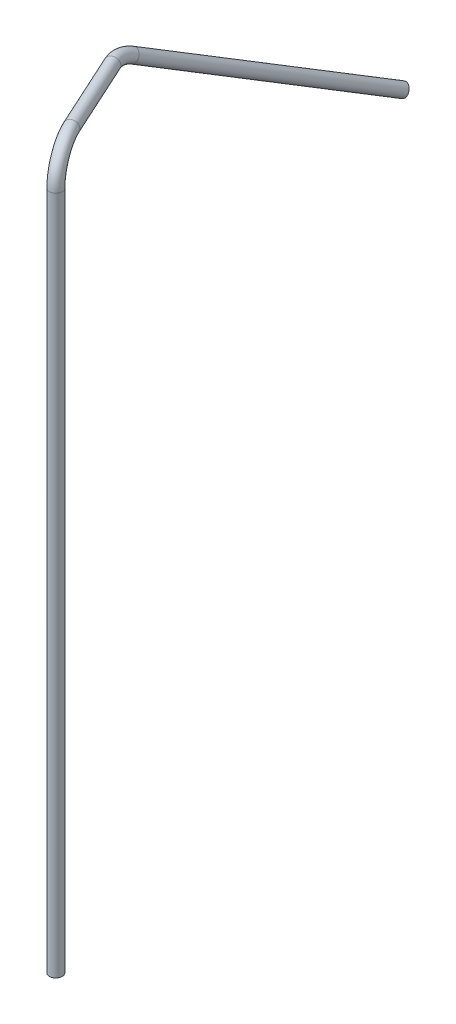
ISO-10303-21;
HEADER;
FILE_DESCRIPTION(('STEP AP214'),'2;1');
FILE_NAME('part.step','',(''),(''),'','','');
FILE_SCHEMA(('AUTOMOTIVE_DESIGN { 1 0 10303 214 1 1 1 1 }'));
ENDSEC;
DATA;
#1=APPLICATION_CONTEXT('core data for automotive mechanical design processes');
#2=APPLICATION_PROTOCOL_DEFINITION('international standard','automotive_design',2000,#1);
#3=PRODUCT_CONTEXT('',#1,'mechanical');
#4=PRODUCT('Part','Part','',(#3));
#5=PRODUCT_RELATED_PRODUCT_CATEGORY('part','',(#4));
#6=PRODUCT_DEFINITION_FORMATION('','',#4);
#7=PRODUCT_DEFINITION_CONTEXT('part definition',#1,'design');
#8=PRODUCT_DEFINITION('design','',#6,#7);
#9=PRODUCT_DEFINITION_SHAPE('','',#8);
#10=(LENGTH_UNIT() NAMED_UNIT(*) SI_UNIT(.MILLI.,.METRE.));
#11=(NAMED_UNIT(*) PLANE_ANGLE_UNIT() SI_UNIT($,.RADIAN.));
#12=(NAMED_UNIT(*) SI_UNIT($,.STERADIAN.) SOLID_ANGLE_UNIT());
#13=UNCERTAINTY_MEASURE_WITH_UNIT(LENGTH_MEASURE(1.E-05),#10,'distance_accuracy_value','');
#14=(GEOMETRIC_REPRESENTATION_CONTEXT(3) GLOBAL_UNCERTAINTY_ASSIGNED_CONTEXT((#13)) GLOBAL_UNIT_ASSIGNED_CONTEXT((#10,
#11,#12)) REPRESENTATION_CONTEXT('',''));
#15=CARTESIAN_POINT('',(0.,0.,0.));
#16=DIRECTION('',(0.,0.,1.));
#17=DIRECTION('',(1.,0.,0.));
#18=AXIS2_PLACEMENT_3D('',#15,#16,#17);
#19=CARTESIAN_POINT('',(0.00647766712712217,-56.6921259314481,-163.561686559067));
#20=DIRECTION('',(0.199985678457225,-0.45276475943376,-0.868912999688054));
#21=DIRECTION('',(-0.458716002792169,0.740368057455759,-0.491360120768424));
#22=AXIS2_PLACEMENT_3D('',#19,#20,#21);
#23=PLANE('',#22);
#24=CARTESIAN_POINT('',(0.00647766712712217,-56.6921259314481,-163.561686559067));
#25=DIRECTION('',(0.199985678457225,-0.45276475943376,-0.868912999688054));
#26=DIRECTION('',(-0.458716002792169,0.740368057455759,-0.491360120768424));
#27=AXIS2_PLACEMENT_3D('',#24,#25,#26);
#28=CIRCLE('',#27,3.);
#29=CARTESIAN_POINT('',(-1.36967034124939,-54.4710217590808,-165.035766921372));
#30=VERTEX_POINT('',#29);
#31=EDGE_CURVE('E70',#30,#30,#28,.T.);
#32=ORIENTED_EDGE('',*,*,#31,.T.);
#33=EDGE_LOOP('',(#32));
#34=FACE_BOUND('',#33,.T.);
#35=ADVANCED_FACE('F41',(#34),#23,.T.);
#36=CARTESIAN_POINT('',(0.,-335.,0.));
#37=DIRECTION('',(0.,1.,0.));
#38=DIRECTION('',(0.,0.,1.));
#39=AXIS2_PLACEMENT_3D('',#36,#37,#38);
#40=PLANE('',#39);
#41=CARTESIAN_POINT('',(0.,-335.,0.));
#42=DIRECTION('',(0.,1.,0.));
#43=DIRECTION('',(0.,0.,1.));
#44=AXIS2_PLACEMENT_3D('',#41,#42,#43);
#45=CIRCLE('',#44,3.);
#46=CARTESIAN_POINT('',(0.,-335.,3.));
#47=VERTEX_POINT('',#46);
#48=EDGE_CURVE('E10',#47,#47,#45,.T.);
#49=ORIENTED_EDGE('',*,*,#48,.F.);
#50=EDGE_LOOP('',(#49));
#51=FACE_BOUND('',#50,.T.);
#52=ADVANCED_FACE('F80',(#51),#40,.F.);
#53=CARTESIAN_POINT('',(0.00647766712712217,-56.6921259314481,-163.561686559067));
#54=DIRECTION('',(-0.199985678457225,0.45276475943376,0.868912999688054));
#55=DIRECTION('',(0.,-0.886827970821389,0.46209971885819));
#56=AXIS2_PLACEMENT_3D('',#53,#54,#55);
#57=CYLINDRICAL_SURFACE('',#56,3.);
#58=CARTESIAN_POINT('',(-23.7918180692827,-2.81311955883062,-60.1610395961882));
#59=DIRECTION('',(0.199985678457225,-0.45276475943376,-0.868912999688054));
#60=DIRECTION('',(-0.458716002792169,0.740368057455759,-0.491360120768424));
#61=AXIS2_PLACEMENT_3D('',#58,#59,#60);
#62=CIRCLE('',#61,3.);
#63=CARTESIAN_POINT('',(-26.1557044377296,-1.45482528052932,-61.4128694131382));
#64=VERTEX_POINT('',#63);
#65=EDGE_CURVE('E66',#64,#64,#62,.T.);
#66=ORIENTED_EDGE('',*,*,#65,.T.);
#67=EDGE_LOOP('',(#66));
#68=FACE_BOUND('',#67,.T.);
#69=ORIENTED_EDGE('',*,*,#31,.F.);
#70=EDGE_LOOP('',(#69));
#71=FACE_BOUND('',#70,.T.);
#72=ADVANCED_FACE('F77',(#68,#71),#57,.T.);
#73=CARTESIAN_POINT('',(-11.9723862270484,-9.60459095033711,-53.9018905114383));
#74=DIRECTION('',(0.582341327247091,0.768119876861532,-0.266215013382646));
#75=DIRECTION('',(-0.796876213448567,0.604142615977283,0.));
#76=AXIS2_PLACEMENT_3D('',#73,#74,#75);
#77=TOROIDAL_SURFACE('',#76,15.,3.);
#78=CARTESIAN_POINT('',(-22.4511550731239,1.6306400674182E-13,-49.111563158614));
#79=DIRECTION('',(-0.415762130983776,0.,-0.909473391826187));
#80=DIRECTION('',(-0.378124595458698,0.909473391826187,0.172858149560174));
#81=AXIS2_PLACEMENT_3D('',#78,#79,#80);
#82=CIRCLE('',#81,3.);
#83=CARTESIAN_POINT('',(-24.546908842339,1.92091819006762,-48.1534976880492));
#84=VERTEX_POINT('',#83);
#85=EDGE_CURVE('E61',#84,#84,#82,.T.);
#86=CARTESIAN_POINT('',(-11.9723862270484,-9.60459095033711,-53.9018905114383));
#87=DIRECTION('',(0.582341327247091,0.768119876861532,-0.266215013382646));
#88=DIRECTION('',(-0.796876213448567,0.604142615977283,0.));
#89=AXIS2_PLACEMENT_3D('',#86,#87,#88);
#90=CIRCLE('',#89,18.);
#91=EDGE_CURVE('',#64,#84,#90,.T.);
#92=ORIENTED_EDGE('',*,*,#65,.F.);
#93=ORIENTED_EDGE('',*,*,#85,.T.);
#94=ORIENTED_EDGE('',*,*,#91,.T.);
#95=ORIENTED_EDGE('',*,*,#91,.F.);
#96=EDGE_LOOP('',(#92,#94,#93,#95));
#97=FACE_BOUND('',#96,.T.);
#98=ADVANCED_FACE('F79',(#97),#77,.T.);
#99=CARTESIAN_POINT('',(-22.4511550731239,1.72079114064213E-13,-49.111563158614));
#100=DIRECTION('',(0.415762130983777,0.,0.909473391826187));
#101=DIRECTION('',(0.909473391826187,0.,-0.415762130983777));
#102=AXIS2_PLACEMENT_3D('',#99,#100,#101);
#103=CYLINDRICAL_SURFACE('',#102,3.);
#104=CARTESIAN_POINT('',(-6.23643196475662,0.,-13.6421008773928));
#105=DIRECTION('',(-0.415762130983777,0.,-0.909473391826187));
#106=DIRECTION('',(-0.378124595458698,0.909473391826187,0.172858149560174));
#107=AXIS2_PLACEMENT_3D('',#104,#105,#106);
#108=CIRCLE('',#107,3.);
#109=CARTESIAN_POINT('',(-6.23643196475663,3.00000000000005,-13.6421008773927));
#110=VERTEX_POINT('',#109);
#111=EDGE_CURVE('E55',#110,#110,#108,.T.);
#112=ORIENTED_EDGE('',*,*,#111,.T.);
#113=EDGE_LOOP('',(#112));
#114=FACE_BOUND('',#113,.T.);
#115=ORIENTED_EDGE('',*,*,#85,.F.);
#116=EDGE_LOOP('',(#115));
#117=FACE_BOUND('',#116,.T.);
#118=ADVANCED_FACE('F87',(#114,#117),#103,.T.);
#119=CARTESIAN_POINT('',(-6.23643196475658,-15.,-13.6421008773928));
#120=DIRECTION('',(0.909473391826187,0.,-0.415762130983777));
#121=DIRECTION('',(-0.415762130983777,0.,-0.909473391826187));
#122=AXIS2_PLACEMENT_3D('',#119,#120,#121);
#123=TOROIDAL_SURFACE('',#122,15.,3.);
#124=CARTESIAN_POINT('',(0.,-15.,-2.01342897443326E-13));
#125=DIRECTION('',(0.,1.,0.));
#126=DIRECTION('',(0.,0.,1.));
#127=AXIS2_PLACEMENT_3D('',#124,#125,#126);
#128=CIRCLE('',#127,3.);
#129=CARTESIAN_POINT('',(1.24728639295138,-15.,2.72842017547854));
#130=VERTEX_POINT('',#129);
#131=EDGE_CURVE('E48',#130,#130,#128,.T.);
#132=CARTESIAN_POINT('',(-6.23643196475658,-15.,-13.6421008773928));
#133=DIRECTION('',(0.909473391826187,0.,-0.415762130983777));
#134=DIRECTION('',(-0.415762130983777,0.,-0.909473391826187));
#135=AXIS2_PLACEMENT_3D('',#132,#133,#134);
#136=CIRCLE('',#135,18.);
#137=EDGE_CURVE('',#110,#130,#136,.T.);
#138=ORIENTED_EDGE('',*,*,#111,.F.);
#139=ORIENTED_EDGE('',*,*,#131,.T.);
#140=ORIENTED_EDGE('',*,*,#137,.T.);
#141=ORIENTED_EDGE('',*,*,#137,.F.);
#142=EDGE_LOOP('',(#138,#140,#139,#141));
#143=FACE_BOUND('',#142,.T.);
#144=ADVANCED_FACE('F93',(#143),#123,.T.);
#145=CARTESIAN_POINT('',(0.,-15.,0.));
#146=DIRECTION('',(0.,-1.,0.));
#147=DIRECTION('',(0.,0.,-1.));
#148=AXIS2_PLACEMENT_3D('',#145,#146,#147);
#149=CYLINDRICAL_SURFACE('',#148,3.);
#150=ORIENTED_EDGE('',*,*,#48,.T.);
#151=EDGE_LOOP('',(#150));
#152=FACE_BOUND('',#151,.T.);
#153=ORIENTED_EDGE('',*,*,#131,.F.);
#154=EDGE_LOOP('',(#153));
#155=FACE_BOUND('',#154,.T.);
#156=ADVANCED_FACE('F91',(#152,#155),#149,.T.);
#157=CLOSED_SHELL('',(#35,#52,#72,#98,#118,#144,#156));
#158=MANIFOLD_SOLID_BREP('B2',#157);
#159=ADVANCED_BREP_SHAPE_REPRESENTATION('',(#18,#158),#14);
#160=SHAPE_DEFINITION_REPRESENTATION(#9,#159);
ENDSEC;
END-ISO-10303-21;
